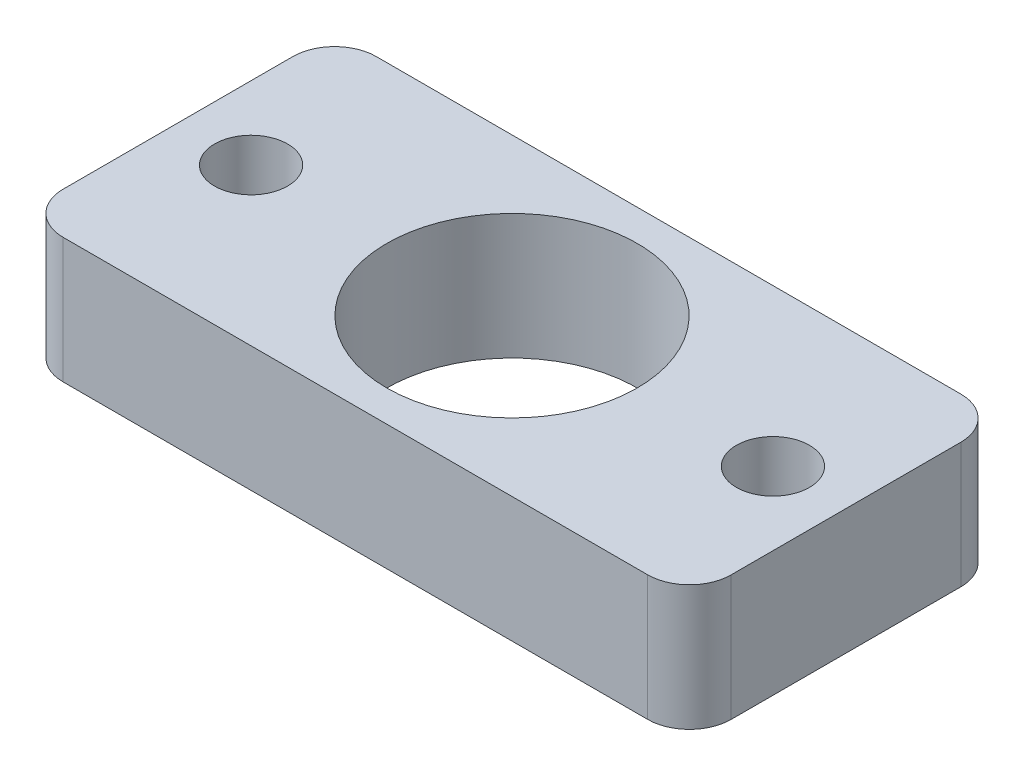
from build123d import *

# Parameters (mm, degrees)
SKETCH1_W                  = 15
SKETCH1_H                  = 6
BOSS_EXTRUDE1_DEPTH        = 16
SKETCH2_R                  = 6
CUT_EXTRUDE1_DEPTH         = 19.661457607
F_3_5_3_5_DIAMETER_HOLE1_D = 3.5
FILLET1_R                  = 2


with BuildPart() as part:
    # Sketch1 → Boss-Extrude1 (new, symmetric)
    with BuildSketch(Plane(origin=(0, 0, 0), x_dir=(0, 0, -1), z_dir=(1, 0, 0))):
        Rectangle(SKETCH1_W, SKETCH1_H)
    extrude(amount=BOSS_EXTRUDE1_DEPTH, both=True)

    # Sketch2 → Cut-Extrude1 (cut, through all)
    with BuildSketch(Plane(origin=(0, 3, 0), x_dir=(1, 0, 0), z_dir=(0, 1, 0))):
        with Locations(Location((0, 0, 0), (0, 0, 270))):
            Circle(SKETCH2_R)
    extrude(amount=-CUT_EXTRUDE1_DEPTH, mode=Mode.SUBTRACT)

    # 3.5 _3.5_ Diameter Hole1 (through all)
    with Locations(Plane(origin=(0, 3, 0), x_dir=(1, 0, 0), z_dir=(0, 1, 0))):
        with Locations((-12.5, 0), (12.5, 0)):
            Hole(F_3_5_3_5_DIAMETER_HOLE1_D / 2)

    # Fillet1
    fillet1_edges = [part.edges().sort_by_distance(p)[0] for p in [
        (16, 0, 7.5),
        (16, 0, -7.5),
        (-16, 0, 7.5),
        (-16, 0, -7.5),
    ]]
    fillet(fillet1_edges, radius=FILLET1_R)


solid = part.part
